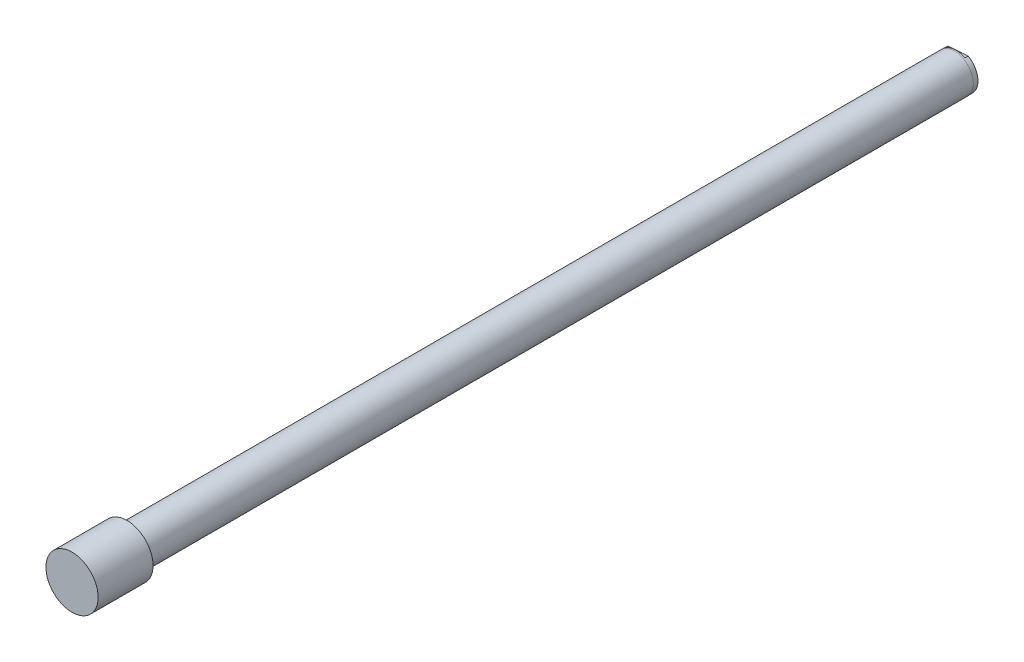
ISO-10303-21;
HEADER;
FILE_DESCRIPTION(('STEP AP214'),'2;1');
FILE_NAME('part.step','',(''),(''),'','','');
FILE_SCHEMA(('AUTOMOTIVE_DESIGN { 1 0 10303 214 1 1 1 1 }'));
ENDSEC;
DATA;
#1=APPLICATION_CONTEXT('core data for automotive mechanical design processes');
#2=APPLICATION_PROTOCOL_DEFINITION('international standard','automotive_design',2000,#1);
#3=PRODUCT_CONTEXT('',#1,'mechanical');
#4=PRODUCT('Part','Part','',(#3));
#5=PRODUCT_RELATED_PRODUCT_CATEGORY('part','',(#4));
#6=PRODUCT_DEFINITION_FORMATION('','',#4);
#7=PRODUCT_DEFINITION_CONTEXT('part definition',#1,'design');
#8=PRODUCT_DEFINITION('design','',#6,#7);
#9=PRODUCT_DEFINITION_SHAPE('','',#8);
#10=(LENGTH_UNIT() NAMED_UNIT(*) SI_UNIT(.MILLI.,.METRE.));
#11=(NAMED_UNIT(*) PLANE_ANGLE_UNIT() SI_UNIT($,.RADIAN.));
#12=(NAMED_UNIT(*) SI_UNIT($,.STERADIAN.) SOLID_ANGLE_UNIT());
#13=UNCERTAINTY_MEASURE_WITH_UNIT(LENGTH_MEASURE(1.E-05),#10,'distance_accuracy_value','');
#14=(GEOMETRIC_REPRESENTATION_CONTEXT(3) GLOBAL_UNCERTAINTY_ASSIGNED_CONTEXT((#13)) GLOBAL_UNIT_ASSIGNED_CONTEXT((#10,
#11,#12)) REPRESENTATION_CONTEXT('',''));
#15=CARTESIAN_POINT('',(0.,0.,0.));
#16=DIRECTION('',(0.,0.,1.));
#17=DIRECTION('',(1.,0.,0.));
#18=AXIS2_PLACEMENT_3D('',#15,#16,#17);
#19=CARTESIAN_POINT('',(0.,0.,29.21));
#20=DIRECTION('',(0.,0.,-1.));
#21=DIRECTION('',(-0.997564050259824,-0.0697564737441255,0.));
#22=AXIS2_PLACEMENT_3D('',#19,#20,#21);
#23=CONICAL_SURFACE('',#22,4.96062,1.02974425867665);
#24=CARTESIAN_POINT('',(0.,0.,32.1906412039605));
#25=VERTEX_POINT('',#24);
#26=VERTEX_LOOP('',#25);
#27=FACE_BOUND('',#26,.T.);
#28=CARTESIAN_POINT('',(0.,0.,29.21));
#29=DIRECTION('',(0.,0.,-1.));
#30=DIRECTION('',(-0.997564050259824,-0.0697564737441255,0.));
#31=AXIS2_PLACEMENT_3D('',#28,#29,#30);
#32=CIRCLE('',#31,4.96062);
#33=CARTESIAN_POINT('',(-4.94853617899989,-0.346035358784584,29.21));
#34=VERTEX_POINT('',#33);
#35=EDGE_CURVE('E68',#34,#34,#32,.T.);
#36=ORIENTED_EDGE('',*,*,#35,.T.);
#37=EDGE_LOOP('',(#36));
#38=FACE_BOUND('',#37,.T.);
#39=ADVANCED_FACE('F16',(#27,#38),#23,.F.);
#40=CARTESIAN_POINT('',(0.,0.,2.54));
#41=DIRECTION('',(0.,0.,-1.));
#42=DIRECTION('',(-0.997564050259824,-0.0697564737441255,0.));
#43=AXIS2_PLACEMENT_3D('',#40,#41,#42);
#44=PLANE('',#43);
#45=DIRECTION('',(-0.997564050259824,-0.0697564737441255,0.));
#46=VECTOR('',#45,1.);
#47=CARTESIAN_POINT('',(8.82413664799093,-11.9866582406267,2.54));
#48=LINE('',#47,#46);
#49=CARTESIAN_POINT('',(8.82413664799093,-11.9866582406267,2.54));
#50=VERTEX_POINT('',#49);
#51=CARTESIAN_POINT('',(-7.07004035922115,-13.0980873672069,2.54));
#52=VERTEX_POINT('',#51);
#53=EDGE_CURVE('E78',#50,#52,#48,.T.);
#54=ORIENTED_EDGE('',*,*,#53,.F.);
#55=CARTESIAN_POINT('',(0.,0.,2.54));
#56=DIRECTION('',(0.,0.,-1.));
#57=DIRECTION('',(-0.997564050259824,-0.0697564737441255,0.));
#58=AXIS2_PLACEMENT_3D('',#55,#56,#57);
#59=CIRCLE('',#58,14.8844);
#60=EDGE_CURVE('E10',#52,#50,#59,.F.);
#61=ORIENTED_EDGE('',*,*,#60,.F.);
#62=EDGE_LOOP('',(#54,#61));
#63=FACE_BOUND('',#62,.T.);
#64=ADVANCED_FACE('F64',(#63),#44,.T.);
#65=CARTESIAN_POINT('',(8.82413664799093,-11.9866582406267,2.54));
#66=DIRECTION('',(0.0697564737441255,-0.997564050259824,0.));
#67=DIRECTION('',(0.,0.,1.));
#68=AXIS2_PLACEMENT_3D('',#65,#66,#67);
#69=PLANE('',#68);
#70=DIRECTION('',(-0.997564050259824,-0.0697564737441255,0.));
#71=VECTOR('',#70,1.);
#72=CARTESIAN_POINT('',(8.82413664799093,-11.9866582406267,0.));
#73=LINE('',#72,#71);
#74=CARTESIAN_POINT('',(8.82413664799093,-11.9866582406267,0.));
#75=VERTEX_POINT('',#74);
#76=CARTESIAN_POINT('',(-7.07004035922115,-13.0980873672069,0.));
#77=VERTEX_POINT('',#76);
#78=EDGE_CURVE('E73',#75,#77,#73,.T.);
#79=ORIENTED_EDGE('',*,*,#78,.F.);
#80=DIRECTION('',(0.,0.,-1.));
#81=VECTOR('',#80,1.);
#82=CARTESIAN_POINT('',(8.82413664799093,-11.9866582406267,2.54));
#83=LINE('',#82,#81);
#84=EDGE_CURVE('E83',#50,#75,#83,.T.);
#85=ORIENTED_EDGE('',*,*,#84,.F.);
#86=ORIENTED_EDGE('',*,*,#53,.T.);
#87=DIRECTION('',(0.,0.,-1.));
#88=VECTOR('',#87,1.);
#89=CARTESIAN_POINT('',(-7.07004035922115,-13.0980873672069,2.54));
#90=LINE('',#89,#88);
#91=EDGE_CURVE('E33',#52,#77,#90,.T.);
#92=ORIENTED_EDGE('',*,*,#91,.T.);
#93=EDGE_LOOP('',(#79,#85,#86,#92));
#94=FACE_BOUND('',#93,.T.);
#95=ADVANCED_FACE('F161',(#94),#69,.T.);
#96=DIRECTION('',(0.997564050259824,0.0697564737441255,0.));
#97=VECTOR('',#96,1.);
#98=CARTESIAN_POINT('',(7.07004035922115,13.0980873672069,2.54));
#99=LINE('',#98,#97);
#100=CARTESIAN_POINT('',(-8.82413664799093,11.9866582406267,2.54));
#101=VERTEX_POINT('',#100);
#102=CARTESIAN_POINT('',(7.07004035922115,13.0980873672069,2.54));
#103=VERTEX_POINT('',#102);
#104=EDGE_CURVE('E80',#101,#103,#99,.T.);
#105=ORIENTED_EDGE('',*,*,#104,.F.);
#106=EDGE_CURVE('E25',#103,#101,#59,.F.);
#107=ORIENTED_EDGE('',*,*,#106,.F.);
#108=EDGE_LOOP('',(#105,#107));
#109=FACE_BOUND('',#108,.T.);
#110=ADVANCED_FACE('F158',(#109),#44,.T.);
#111=CARTESIAN_POINT('',(7.07004035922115,13.0980873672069,2.54));
#112=DIRECTION('',(-0.0697564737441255,0.997564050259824,0.));
#113=DIRECTION('',(0.,0.,-1.));
#114=AXIS2_PLACEMENT_3D('',#111,#112,#113);
#115=PLANE('',#114);
#116=DIRECTION('',(0.997564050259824,0.0697564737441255,0.));
#117=VECTOR('',#116,1.);
#118=CARTESIAN_POINT('',(7.07004035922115,13.0980873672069,0.));
#119=LINE('',#118,#117);
#120=CARTESIAN_POINT('',(-8.82413664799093,11.9866582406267,0.));
#121=VERTEX_POINT('',#120);
#122=CARTESIAN_POINT('',(7.07004035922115,13.0980873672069,0.));
#123=VERTEX_POINT('',#122);
#124=EDGE_CURVE('E81',#121,#123,#119,.T.);
#125=ORIENTED_EDGE('',*,*,#124,.F.);
#126=DIRECTION('',(0.,0.,-1.));
#127=VECTOR('',#126,1.);
#128=CARTESIAN_POINT('',(-8.82413664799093,11.9866582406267,2.54));
#129=LINE('',#128,#127);
#130=EDGE_CURVE('E88',#101,#121,#129,.T.);
#131=ORIENTED_EDGE('',*,*,#130,.F.);
#132=ORIENTED_EDGE('',*,*,#104,.T.);
#133=DIRECTION('',(0.,0.,-1.));
#134=VECTOR('',#133,1.);
#135=CARTESIAN_POINT('',(7.07004035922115,13.0980873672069,2.54));
#136=LINE('',#135,#134);
#137=EDGE_CURVE('E41',#103,#123,#136,.T.);
#138=ORIENTED_EDGE('',*,*,#137,.T.);
#139=EDGE_LOOP('',(#125,#131,#132,#138));
#140=FACE_BOUND('',#139,.T.);
#141=ADVANCED_FACE('F156',(#140),#115,.T.);
#142=CARTESIAN_POINT('',(0.,0.,0.));
#143=DIRECTION('',(0.,0.,-1.));
#144=DIRECTION('',(-0.997564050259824,-0.0697564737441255,0.));
#145=AXIS2_PLACEMENT_3D('',#142,#143,#144);
#146=PLANE('',#145);
#147=CARTESIAN_POINT('',(0.,0.,0.));
#148=DIRECTION('',(0.,0.,-1.));
#149=DIRECTION('',(-0.997564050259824,-0.0697564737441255,0.));
#150=AXIS2_PLACEMENT_3D('',#147,#148,#149);
#151=CIRCLE('',#150,4.96062);
#152=CARTESIAN_POINT('',(-4.94853617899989,-0.346035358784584,0.));
#153=VERTEX_POINT('',#152);
#154=EDGE_CURVE('E70',#153,#153,#151,.T.);
#155=ORIENTED_EDGE('',*,*,#154,.F.);
#156=EDGE_LOOP('',(#155));
#157=FACE_BOUND('',#156,.T.);
#158=CARTESIAN_POINT('',(0.,0.,0.));
#159=DIRECTION('',(0.,0.,-1.));
#160=DIRECTION('',(-0.997564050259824,-0.0697564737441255,0.));
#161=AXIS2_PLACEMENT_3D('',#158,#159,#160);
#162=CIRCLE('',#161,14.8844);
#163=EDGE_CURVE('E96',#77,#121,#162,.T.);
#164=ORIENTED_EDGE('',*,*,#163,.T.);
#165=ORIENTED_EDGE('',*,*,#124,.T.);
#166=EDGE_CURVE('E98',#123,#75,#162,.T.);
#167=ORIENTED_EDGE('',*,*,#166,.T.);
#168=ORIENTED_EDGE('',*,*,#78,.T.);
#169=EDGE_LOOP('',(#164,#165,#167,#168));
#170=FACE_BOUND('',#169,.T.);
#171=ADVANCED_FACE('F149',(#157,#170),#146,.T.);
#172=CARTESIAN_POINT('',(0.,0.,0.));
#173=DIRECTION('',(0.,0.,-1.));
#174=DIRECTION('',(-0.997564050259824,-0.0697564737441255,0.));
#175=AXIS2_PLACEMENT_3D('',#172,#173,#174);
#176=CYLINDRICAL_SURFACE('',#175,4.96062);
#177=ORIENTED_EDGE('',*,*,#154,.T.);
#178=EDGE_LOOP('',(#177));
#179=FACE_BOUND('',#178,.T.);
#180=ORIENTED_EDGE('',*,*,#35,.F.);
#181=EDGE_LOOP('',(#180));
#182=FACE_BOUND('',#181,.T.);
#183=ADVANCED_FACE('F142',(#179,#182),#176,.F.);
#184=CARTESIAN_POINT('',(0.,0.,2.54));
#185=DIRECTION('',(0.,0.,-1.));
#186=DIRECTION('',(-0.997564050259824,-0.0697564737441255,0.));
#187=AXIS2_PLACEMENT_3D('',#184,#185,#186);
#188=CYLINDRICAL_SURFACE('',#187,14.8844);
#189=ORIENTED_EDGE('',*,*,#166,.F.);
#190=ORIENTED_EDGE('',*,*,#137,.F.);
#191=ORIENTED_EDGE('',*,*,#106,.T.);
#192=ORIENTED_EDGE('',*,*,#130,.T.);
#193=ORIENTED_EDGE('',*,*,#163,.F.);
#194=ORIENTED_EDGE('',*,*,#91,.F.);
#195=ORIENTED_EDGE('',*,*,#60,.T.);
#196=ORIENTED_EDGE('',*,*,#84,.T.);
#197=EDGE_LOOP('',(#189,#190,#191,#192,#193,#194,#195,#196));
#198=FACE_BOUND('',#197,.T.);
#199=CARTESIAN_POINT('',(0.,0.,3.81));
#200=DIRECTION('',(0.,0.,1.));
#201=DIRECTION('',(0.997564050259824,0.0697564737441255,0.));
#202=AXIS2_PLACEMENT_3D('',#199,#200,#201);
#203=CIRCLE('',#202,14.8844);
#204=CARTESIAN_POINT('',(14.8481423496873,1.03828325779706,3.81));
#205=VERTEX_POINT('',#204);
#206=EDGE_CURVE('E87',#205,#205,#203,.T.);
#207=ORIENTED_EDGE('',*,*,#206,.F.);
#208=EDGE_LOOP('',(#207));
#209=FACE_BOUND('',#208,.T.);
#210=ADVANCED_FACE('F126',(#198,#209),#188,.T.);
#211=CARTESIAN_POINT('',(0.,0.,701.802));
#212=DIRECTION('',(0.,0.,1.));
#213=DIRECTION('',(1.,0.,0.));
#214=AXIS2_PLACEMENT_3D('',#211,#212,#213);
#215=PLANE('',#214);
#216=CARTESIAN_POINT('',(0.,0.,701.802));
#217=DIRECTION('',(0.,0.,1.));
#218=DIRECTION('',(1.,0.,0.));
#219=AXIS2_PLACEMENT_3D('',#216,#217,#218);
#220=CIRCLE('',#219,20.6375);
#221=CARTESIAN_POINT('',(20.6375,0.,701.802));
#222=VERTEX_POINT('',#221);
#223=EDGE_CURVE('E100',#222,#222,#220,.T.);
#224=ORIENTED_EDGE('',*,*,#223,.T.);
#225=EDGE_LOOP('',(#224));
#226=FACE_BOUND('',#225,.T.);
#227=ADVANCED_FACE('F118',(#226),#215,.T.);
#228=CARTESIAN_POINT('',(0.,0.,701.802));
#229=DIRECTION('',(0.,0.,-1.));
#230=DIRECTION('',(-1.,0.,0.));
#231=AXIS2_PLACEMENT_3D('',#228,#229,#230);
#232=CYLINDRICAL_SURFACE('',#231,20.6375);
#233=ORIENTED_EDGE('',*,*,#223,.F.);
#234=EDGE_LOOP('',(#233));
#235=FACE_BOUND('',#234,.T.);
#236=CARTESIAN_POINT('',(0.,0.,658.368));
#237=DIRECTION('',(0.,0.,1.));
#238=DIRECTION('',(1.,0.,0.));
#239=AXIS2_PLACEMENT_3D('',#236,#237,#238);
#240=CIRCLE('',#239,20.6375);
#241=CARTESIAN_POINT('',(20.6375,0.,658.368));
#242=VERTEX_POINT('',#241);
#243=EDGE_CURVE('E103',#242,#242,#240,.T.);
#244=ORIENTED_EDGE('',*,*,#243,.T.);
#245=EDGE_LOOP('',(#244));
#246=FACE_BOUND('',#245,.T.);
#247=ADVANCED_FACE('F112',(#235,#246),#232,.T.);
#248=CARTESIAN_POINT('',(0.,0.,658.368));
#249=DIRECTION('',(0.,0.,1.));
#250=DIRECTION('',(1.,0.,0.));
#251=AXIS2_PLACEMENT_3D('',#248,#249,#250);
#252=PLANE('',#251);
#253=CARTESIAN_POINT('',(0.,0.,658.368));
#254=DIRECTION('',(0.,0.,1.));
#255=DIRECTION('',(1.,0.,0.));
#256=AXIS2_PLACEMENT_3D('',#253,#254,#255);
#257=CIRCLE('',#256,14.9987);
#258=CARTESIAN_POINT('',(14.9987,0.,658.368));
#259=VERTEX_POINT('',#258);
#260=EDGE_CURVE('E76',#259,#259,#257,.F.);
#261=ORIENTED_EDGE('',*,*,#260,.F.);
#262=EDGE_LOOP('',(#261));
#263=FACE_BOUND('',#262,.T.);
#264=ORIENTED_EDGE('',*,*,#243,.F.);
#265=EDGE_LOOP('',(#264));
#266=FACE_BOUND('',#265,.T.);
#267=ADVANCED_FACE('F109',(#263,#266),#252,.F.);
#268=CARTESIAN_POINT('',(0.,0.,658.368));
#269=DIRECTION('',(0.,0.,-1.));
#270=DIRECTION('',(-1.,0.,0.));
#271=AXIS2_PLACEMENT_3D('',#268,#269,#270);
#272=CYLINDRICAL_SURFACE('',#271,14.9987);
#273=CARTESIAN_POINT('',(0.,0.,3.81));
#274=DIRECTION('',(0.,0.,-1.));
#275=DIRECTION('',(-1.,0.,0.));
#276=AXIS2_PLACEMENT_3D('',#273,#274,#275);
#277=CIRCLE('',#276,14.9987);
#278=CARTESIAN_POINT('',(-14.9987,0.,3.81));
#279=VERTEX_POINT('',#278);
#280=EDGE_CURVE('E20',#279,#279,#277,.T.);
#281=ORIENTED_EDGE('',*,*,#280,.F.);
#282=EDGE_LOOP('',(#281));
#283=FACE_BOUND('',#282,.T.);
#284=ORIENTED_EDGE('',*,*,#260,.T.);
#285=EDGE_LOOP('',(#284));
#286=FACE_BOUND('',#285,.T.);
#287=ADVANCED_FACE('F18',(#283,#286),#272,.T.);
#288=CARTESIAN_POINT('',(0.,0.,3.81));
#289=DIRECTION('',(0.,0.,-1.));
#290=DIRECTION('',(-1.,0.,0.));
#291=AXIS2_PLACEMENT_3D('',#288,#289,#290);
#292=PLANE('',#291);
#293=ORIENTED_EDGE('',*,*,#206,.T.);
#294=EDGE_LOOP('',(#293));
#295=FACE_BOUND('',#294,.T.);
#296=ORIENTED_EDGE('',*,*,#280,.T.);
#297=EDGE_LOOP('',(#296));
#298=FACE_BOUND('',#297,.T.);
#299=ADVANCED_FACE('F114',(#295,#298),#292,.T.);
#300=CLOSED_SHELL('',(#39,#64,#95,#110,#141,#171,#183,#210,#227,#247,#267,#287,#299));
#301=MANIFOLD_SOLID_BREP('B1',#300);
#302=ADVANCED_BREP_SHAPE_REPRESENTATION('',(#18,#301),#14);
#303=SHAPE_DEFINITION_REPRESENTATION(#9,#302);
ENDSEC;
END-ISO-10303-21;
